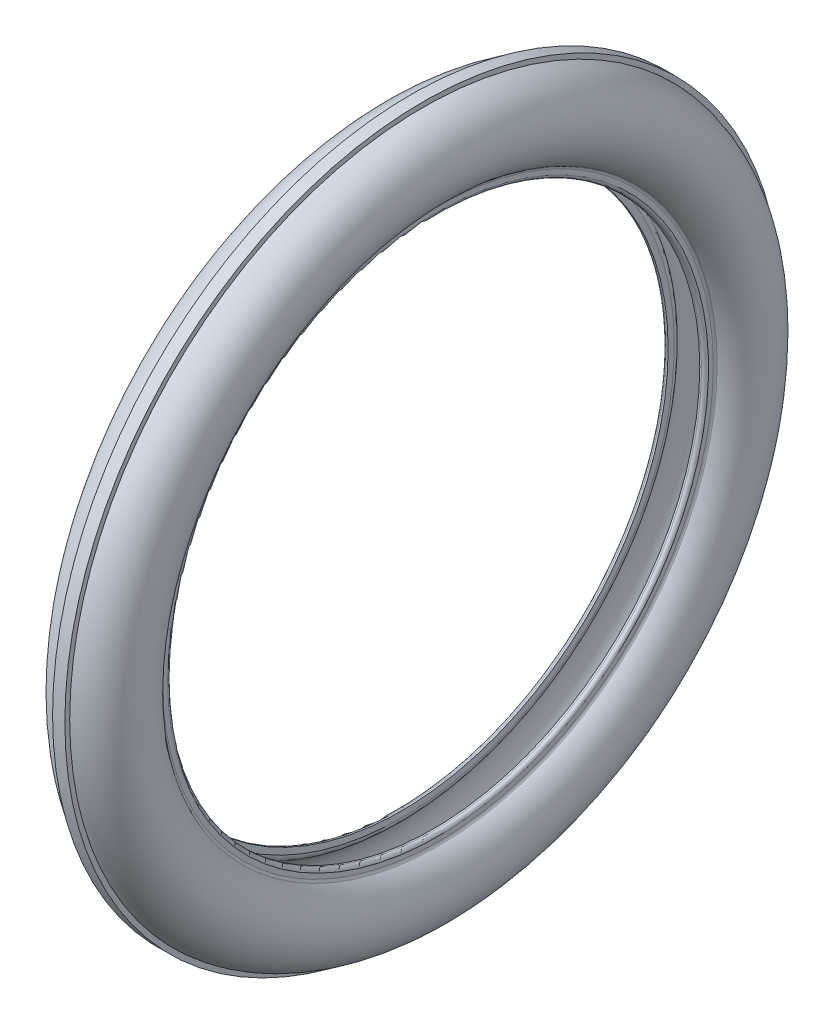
from build123d import *


with BuildPart() as part:
    # Esquisse1 → R_volution1 (revolve)
    with BuildSketch(Plane.XY, mode=Mode.PRIVATE) as r_volution1_sk:
        with BuildLine():
            Line((-9, 152), (-10, 152))
            ThreePointArc((-10, 152), (-11.414213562, 152.585786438), (-12, 154))
            Line((-12, 154), (-12, 156.712339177))
            ThreePointArc((-12, 156.712339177), (-12.177441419, 157.535916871), (-12.678280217, 158.21335777))
            ThreePointArc((-12.678280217, 158.21335777), (-22.982863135, 182.902856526), (-3.5, 201.237900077))
            Line((-3.5, 201.237900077), (-3.5, 204))
            Line((-3.5, 204), (0, 204))
            Line((0, 204), (0, 200))
            ThreePointArc((0, 200), (-21.250368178, 183.694018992), (-11, 158.947441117))
            ThreePointArc((-11, 158.947441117), (-9.535898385, 157.483339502), (-9, 155.483339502))
            Line((-9, 155.483339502), (-9, 152))
        make_face()
    revolve(r_volution1_sk.sketch.rotate(Axis((0, 0, 0), (1, 0, 0)), 90), axis=Axis((0, 0, 0), (1, 0, 0)))

    # Sym_trie2: part across plane


with BuildPart() as part_1:
    add(part.part)
    add(part.part.mirror(Plane(origin=(0, 0, 0), x_dir=(0, 0, 1), z_dir=(1, 0, 0))))


solid = part_1.part
